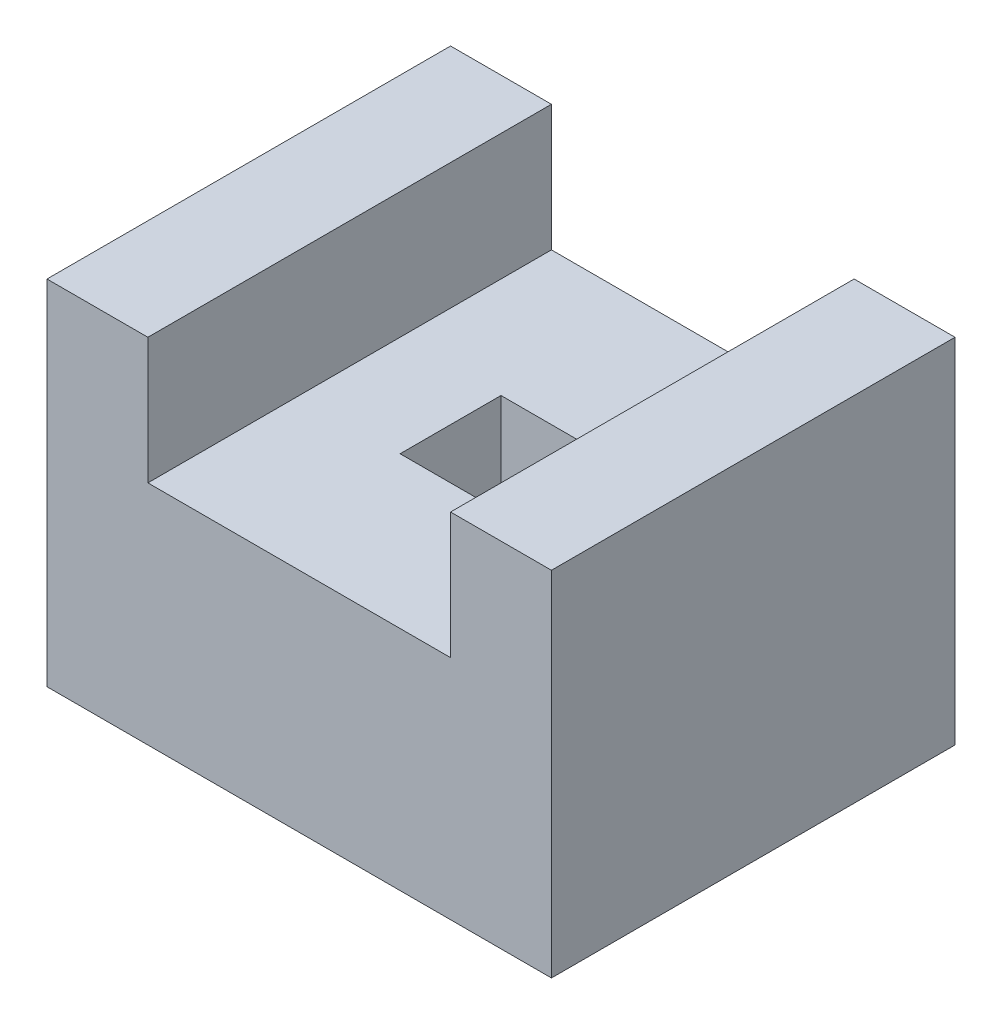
ISO-10303-21;
HEADER;
FILE_DESCRIPTION(('STEP AP214'),'2;1');
FILE_NAME('part.step','',(''),(''),'','','');
FILE_SCHEMA(('AUTOMOTIVE_DESIGN { 1 0 10303 214 1 1 1 1 }'));
ENDSEC;
DATA;
#1=APPLICATION_CONTEXT('core data for automotive mechanical design processes');
#2=APPLICATION_PROTOCOL_DEFINITION('international standard','automotive_design',2000,#1);
#3=PRODUCT_CONTEXT('',#1,'mechanical');
#4=PRODUCT('Part','Part','',(#3));
#5=PRODUCT_RELATED_PRODUCT_CATEGORY('part','',(#4));
#6=PRODUCT_DEFINITION_FORMATION('','',#4);
#7=PRODUCT_DEFINITION_CONTEXT('part definition',#1,'design');
#8=PRODUCT_DEFINITION('design','',#6,#7);
#9=PRODUCT_DEFINITION_SHAPE('','',#8);
#10=(LENGTH_UNIT() NAMED_UNIT(*) SI_UNIT(.MILLI.,.METRE.));
#11=(NAMED_UNIT(*) PLANE_ANGLE_UNIT() SI_UNIT($,.RADIAN.));
#12=(NAMED_UNIT(*) SI_UNIT($,.STERADIAN.) SOLID_ANGLE_UNIT());
#13=UNCERTAINTY_MEASURE_WITH_UNIT(LENGTH_MEASURE(1.E-05),#10,'distance_accuracy_value','');
#14=(GEOMETRIC_REPRESENTATION_CONTEXT(3) GLOBAL_UNCERTAINTY_ASSIGNED_CONTEXT((#13)) GLOBAL_UNIT_ASSIGNED_CONTEXT((#10,
#11,#12)) REPRESENTATION_CONTEXT('',''));
#15=CARTESIAN_POINT('',(0.,0.,0.));
#16=DIRECTION('',(0.,0.,1.));
#17=DIRECTION('',(1.,0.,0.));
#18=AXIS2_PLACEMENT_3D('',#15,#16,#17);
#19=CARTESIAN_POINT('',(-50.,35.,-80.));
#20=DIRECTION('',(-1.,0.,0.));
#21=DIRECTION('',(0.,0.,1.));
#22=AXIS2_PLACEMENT_3D('',#19,#20,#21);
#23=PLANE('',#22);
#24=DIRECTION('',(0.,-1.,0.));
#25=VECTOR('',#24,1.);
#26=CARTESIAN_POINT('',(-50.,35.,0.));
#27=LINE('',#26,#25);
#28=CARTESIAN_POINT('',(-50.,35.,0.));
#29=VERTEX_POINT('',#28);
#30=CARTESIAN_POINT('',(-50.,-35.,0.));
#31=VERTEX_POINT('',#30);
#32=EDGE_CURVE('E153',#29,#31,#27,.T.);
#33=ORIENTED_EDGE('',*,*,#32,.F.);
#34=DIRECTION('',(0.,0.,1.));
#35=VECTOR('',#34,1.);
#36=CARTESIAN_POINT('',(-50.,35.,-80.));
#37=LINE('',#36,#35);
#38=CARTESIAN_POINT('',(-50.,35.,-80.));
#39=VERTEX_POINT('',#38);
#40=EDGE_CURVE('E11',#39,#29,#37,.T.);
#41=ORIENTED_EDGE('',*,*,#40,.F.);
#42=DIRECTION('',(0.,-1.,0.));
#43=VECTOR('',#42,1.);
#44=CARTESIAN_POINT('',(-50.,35.,-80.));
#45=LINE('',#44,#43);
#46=CARTESIAN_POINT('',(-50.,-35.,-80.));
#47=VERTEX_POINT('',#46);
#48=EDGE_CURVE('E157',#39,#47,#45,.T.);
#49=ORIENTED_EDGE('',*,*,#48,.T.);
#50=DIRECTION('',(0.,0.,1.));
#51=VECTOR('',#50,1.);
#52=CARTESIAN_POINT('',(-50.,-35.,-80.));
#53=LINE('',#52,#51);
#54=EDGE_CURVE('E34',#47,#31,#53,.T.);
#55=ORIENTED_EDGE('',*,*,#54,.T.);
#56=EDGE_LOOP('',(#33,#41,#49,#55));
#57=FACE_BOUND('',#56,.T.);
#58=ADVANCED_FACE('F31',(#57),#23,.T.);
#59=CARTESIAN_POINT('',(-50.,35.,-80.));
#60=DIRECTION('',(0.,1.,0.));
#61=DIRECTION('',(0.,0.,1.));
#62=AXIS2_PLACEMENT_3D('',#59,#60,#61);
#63=PLANE('',#62);
#64=DIRECTION('',(-1.,0.,0.));
#65=VECTOR('',#64,1.);
#66=CARTESIAN_POINT('',(-50.,35.,0.));
#67=LINE('',#66,#65);
#68=CARTESIAN_POINT('',(-30.,35.,0.));
#69=VERTEX_POINT('',#68);
#70=EDGE_CURVE('E161',#69,#29,#67,.T.);
#71=ORIENTED_EDGE('',*,*,#70,.F.);
#72=DIRECTION('',(0.,0.,1.));
#73=VECTOR('',#72,1.);
#74=CARTESIAN_POINT('',(-30.,35.,-80.));
#75=LINE('',#74,#73);
#76=CARTESIAN_POINT('',(-30.,35.,-80.));
#77=VERTEX_POINT('',#76);
#78=EDGE_CURVE('E39',#77,#69,#75,.T.);
#79=ORIENTED_EDGE('',*,*,#78,.F.);
#80=DIRECTION('',(-1.,0.,0.));
#81=VECTOR('',#80,1.);
#82=CARTESIAN_POINT('',(-50.,35.,-80.));
#83=LINE('',#82,#81);
#84=EDGE_CURVE('E179',#77,#39,#83,.T.);
#85=ORIENTED_EDGE('',*,*,#84,.T.);
#86=ORIENTED_EDGE('',*,*,#40,.T.);
#87=EDGE_LOOP('',(#71,#79,#85,#86));
#88=FACE_BOUND('',#87,.T.);
#89=ADVANCED_FACE('F224',(#88),#63,.T.);
#90=CARTESIAN_POINT('',(-30.,10.,-80.));
#91=DIRECTION('',(1.,0.,0.));
#92=DIRECTION('',(0.,1.,0.));
#93=AXIS2_PLACEMENT_3D('',#90,#91,#92);
#94=PLANE('',#93);
#95=DIRECTION('',(0.,1.,0.));
#96=VECTOR('',#95,1.);
#97=CARTESIAN_POINT('',(-30.,10.,0.));
#98=LINE('',#97,#96);
#99=CARTESIAN_POINT('',(-30.,10.,0.));
#100=VERTEX_POINT('',#99);
#101=EDGE_CURVE('E199',#100,#69,#98,.T.);
#102=ORIENTED_EDGE('',*,*,#101,.F.);
#103=DIRECTION('',(0.,0.,1.));
#104=VECTOR('',#103,1.);
#105=CARTESIAN_POINT('',(-30.,10.,-80.));
#106=LINE('',#105,#104);
#107=CARTESIAN_POINT('',(-30.,10.,-80.));
#108=VERTEX_POINT('',#107);
#109=EDGE_CURVE('E205',#108,#100,#106,.T.);
#110=ORIENTED_EDGE('',*,*,#109,.F.);
#111=DIRECTION('',(0.,1.,0.));
#112=VECTOR('',#111,1.);
#113=CARTESIAN_POINT('',(-30.,10.,-80.));
#114=LINE('',#113,#112);
#115=EDGE_CURVE('E176',#108,#77,#114,.T.);
#116=ORIENTED_EDGE('',*,*,#115,.T.);
#117=ORIENTED_EDGE('',*,*,#78,.T.);
#118=EDGE_LOOP('',(#102,#110,#116,#117));
#119=FACE_BOUND('',#118,.T.);
#120=ADVANCED_FACE('F245',(#119),#94,.T.);
#121=CARTESIAN_POINT('',(30.,10.,-80.));
#122=DIRECTION('',(0.,1.,0.));
#123=DIRECTION('',(0.,0.,1.));
#124=AXIS2_PLACEMENT_3D('',#121,#122,#123);
#125=PLANE('',#124);
#126=DIRECTION('',(0.,0.,1.));
#127=VECTOR('',#126,1.);
#128=CARTESIAN_POINT('',(-10.,10.,-50.));
#129=LINE('',#128,#127);
#130=CARTESIAN_POINT('',(-10.,10.,-50.));
#131=VERTEX_POINT('',#130);
#132=CARTESIAN_POINT('',(-10.,10.,-30.));
#133=VERTEX_POINT('',#132);
#134=EDGE_CURVE('E47',#131,#133,#129,.T.);
#135=ORIENTED_EDGE('',*,*,#134,.F.);
#136=DIRECTION('',(-1.,0.,0.));
#137=VECTOR('',#136,1.);
#138=CARTESIAN_POINT('',(-10.,10.,-50.));
#139=LINE('',#138,#137);
#140=CARTESIAN_POINT('',(10.,10.,-50.));
#141=VERTEX_POINT('',#140);
#142=EDGE_CURVE('E138',#141,#131,#139,.T.);
#143=ORIENTED_EDGE('',*,*,#142,.F.);
#144=DIRECTION('',(0.,0.,-1.));
#145=VECTOR('',#144,1.);
#146=CARTESIAN_POINT('',(10.,10.,-50.));
#147=LINE('',#146,#145);
#148=CARTESIAN_POINT('',(10.,10.,-30.));
#149=VERTEX_POINT('',#148);
#150=EDGE_CURVE('E141',#149,#141,#147,.T.);
#151=ORIENTED_EDGE('',*,*,#150,.F.);
#152=DIRECTION('',(1.,0.,0.));
#153=VECTOR('',#152,1.);
#154=CARTESIAN_POINT('',(-10.,10.,-30.));
#155=LINE('',#154,#153);
#156=EDGE_CURVE('E147',#133,#149,#155,.T.);
#157=ORIENTED_EDGE('',*,*,#156,.F.);
#158=EDGE_LOOP('',(#135,#143,#151,#157));
#159=FACE_BOUND('',#158,.T.);
#160=DIRECTION('',(-1.,0.,0.));
#161=VECTOR('',#160,1.);
#162=CARTESIAN_POINT('',(30.,10.,0.));
#163=LINE('',#162,#161);
#164=CARTESIAN_POINT('',(30.,10.,0.));
#165=VERTEX_POINT('',#164);
#166=EDGE_CURVE('E196',#165,#100,#163,.T.);
#167=ORIENTED_EDGE('',*,*,#166,.F.);
#168=DIRECTION('',(0.,0.,1.));
#169=VECTOR('',#168,1.);
#170=CARTESIAN_POINT('',(30.,10.,-80.));
#171=LINE('',#170,#169);
#172=CARTESIAN_POINT('',(30.,10.,-80.));
#173=VERTEX_POINT('',#172);
#174=EDGE_CURVE('E207',#173,#165,#171,.T.);
#175=ORIENTED_EDGE('',*,*,#174,.F.);
#176=DIRECTION('',(-1.,0.,0.));
#177=VECTOR('',#176,1.);
#178=CARTESIAN_POINT('',(30.,10.,-80.));
#179=LINE('',#178,#177);
#180=EDGE_CURVE('E173',#173,#108,#179,.T.);
#181=ORIENTED_EDGE('',*,*,#180,.T.);
#182=ORIENTED_EDGE('',*,*,#109,.T.);
#183=EDGE_LOOP('',(#167,#175,#181,#182));
#184=FACE_BOUND('',#183,.T.);
#185=ADVANCED_FACE('F243',(#159,#184),#125,.T.);
#186=CARTESIAN_POINT('',(30.,35.,-80.));
#187=DIRECTION('',(-1.,0.,0.));
#188=DIRECTION('',(0.,-1.,0.));
#189=AXIS2_PLACEMENT_3D('',#186,#187,#188);
#190=PLANE('',#189);
#191=DIRECTION('',(0.,-1.,0.));
#192=VECTOR('',#191,1.);
#193=CARTESIAN_POINT('',(30.,35.,0.));
#194=LINE('',#193,#192);
#195=CARTESIAN_POINT('',(30.,35.,0.));
#196=VERTEX_POINT('',#195);
#197=EDGE_CURVE('E193',#196,#165,#194,.T.);
#198=ORIENTED_EDGE('',*,*,#197,.F.);
#199=DIRECTION('',(0.,0.,1.));
#200=VECTOR('',#199,1.);
#201=CARTESIAN_POINT('',(30.,35.,-80.));
#202=LINE('',#201,#200);
#203=CARTESIAN_POINT('',(30.,35.,-80.));
#204=VERTEX_POINT('',#203);
#205=EDGE_CURVE('E209',#204,#196,#202,.T.);
#206=ORIENTED_EDGE('',*,*,#205,.F.);
#207=DIRECTION('',(0.,-1.,0.));
#208=VECTOR('',#207,1.);
#209=CARTESIAN_POINT('',(30.,35.,-80.));
#210=LINE('',#209,#208);
#211=EDGE_CURVE('E170',#204,#173,#210,.T.);
#212=ORIENTED_EDGE('',*,*,#211,.T.);
#213=ORIENTED_EDGE('',*,*,#174,.T.);
#214=EDGE_LOOP('',(#198,#206,#212,#213));
#215=FACE_BOUND('',#214,.T.);
#216=ADVANCED_FACE('F239',(#215),#190,.T.);
#217=CARTESIAN_POINT('',(30.,35.,-80.));
#218=DIRECTION('',(0.,1.,0.));
#219=DIRECTION('',(0.,0.,1.));
#220=AXIS2_PLACEMENT_3D('',#217,#218,#219);
#221=PLANE('',#220);
#222=DIRECTION('',(-1.,0.,0.));
#223=VECTOR('',#222,1.);
#224=CARTESIAN_POINT('',(30.,35.,0.));
#225=LINE('',#224,#223);
#226=CARTESIAN_POINT('',(50.,35.,0.));
#227=VERTEX_POINT('',#226);
#228=EDGE_CURVE('E190',#227,#196,#225,.T.);
#229=ORIENTED_EDGE('',*,*,#228,.F.);
#230=DIRECTION('',(0.,0.,1.));
#231=VECTOR('',#230,1.);
#232=CARTESIAN_POINT('',(50.,35.,-80.));
#233=LINE('',#232,#231);
#234=CARTESIAN_POINT('',(50.,35.,-80.));
#235=VERTEX_POINT('',#234);
#236=EDGE_CURVE('E211',#235,#227,#233,.T.);
#237=ORIENTED_EDGE('',*,*,#236,.F.);
#238=DIRECTION('',(-1.,0.,0.));
#239=VECTOR('',#238,1.);
#240=CARTESIAN_POINT('',(30.,35.,-80.));
#241=LINE('',#240,#239);
#242=EDGE_CURVE('E167',#235,#204,#241,.T.);
#243=ORIENTED_EDGE('',*,*,#242,.T.);
#244=ORIENTED_EDGE('',*,*,#205,.T.);
#245=EDGE_LOOP('',(#229,#237,#243,#244));
#246=FACE_BOUND('',#245,.T.);
#247=ADVANCED_FACE('F237',(#246),#221,.T.);
#248=CARTESIAN_POINT('',(50.,35.,-80.));
#249=DIRECTION('',(1.,0.,0.));
#250=DIRECTION('',(0.,0.,-1.));
#251=AXIS2_PLACEMENT_3D('',#248,#249,#250);
#252=PLANE('',#251);
#253=DIRECTION('',(0.,1.,0.));
#254=VECTOR('',#253,1.);
#255=CARTESIAN_POINT('',(50.,35.,0.));
#256=LINE('',#255,#254);
#257=CARTESIAN_POINT('',(50.,-35.,0.));
#258=VERTEX_POINT('',#257);
#259=EDGE_CURVE('E187',#258,#227,#256,.T.);
#260=ORIENTED_EDGE('',*,*,#259,.F.);
#261=DIRECTION('',(0.,0.,1.));
#262=VECTOR('',#261,1.);
#263=CARTESIAN_POINT('',(50.,-35.,-80.));
#264=LINE('',#263,#262);
#265=CARTESIAN_POINT('',(50.,-35.,-80.));
#266=VERTEX_POINT('',#265);
#267=EDGE_CURVE('E212',#266,#258,#264,.T.);
#268=ORIENTED_EDGE('',*,*,#267,.F.);
#269=DIRECTION('',(0.,1.,0.));
#270=VECTOR('',#269,1.);
#271=CARTESIAN_POINT('',(50.,35.,-80.));
#272=LINE('',#271,#270);
#273=EDGE_CURVE('E164',#266,#235,#272,.T.);
#274=ORIENTED_EDGE('',*,*,#273,.T.);
#275=ORIENTED_EDGE('',*,*,#236,.T.);
#276=EDGE_LOOP('',(#260,#268,#274,#275));
#277=FACE_BOUND('',#276,.T.);
#278=ADVANCED_FACE('F233',(#277),#252,.T.);
#279=CARTESIAN_POINT('',(-50.,-35.,-80.));
#280=DIRECTION('',(0.,-1.,0.));
#281=DIRECTION('',(0.,0.,-1.));
#282=AXIS2_PLACEMENT_3D('',#279,#280,#281);
#283=PLANE('',#282);
#284=DIRECTION('',(0.,0.,1.));
#285=VECTOR('',#284,1.);
#286=CARTESIAN_POINT('',(-10.,-35.,-50.));
#287=LINE('',#286,#285);
#288=CARTESIAN_POINT('',(-10.,-35.,-50.));
#289=VERTEX_POINT('',#288);
#290=CARTESIAN_POINT('',(-10.,-35.,-30.));
#291=VERTEX_POINT('',#290);
#292=EDGE_CURVE('E122',#289,#291,#287,.T.);
#293=ORIENTED_EDGE('',*,*,#292,.T.);
#294=DIRECTION('',(1.,0.,0.));
#295=VECTOR('',#294,1.);
#296=CARTESIAN_POINT('',(-10.,-35.,-30.));
#297=LINE('',#296,#295);
#298=CARTESIAN_POINT('',(9.99999999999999,-35.,-30.));
#299=VERTEX_POINT('',#298);
#300=EDGE_CURVE('E131',#291,#299,#297,.T.);
#301=ORIENTED_EDGE('',*,*,#300,.T.);
#302=DIRECTION('',(0.,0.,-1.));
#303=VECTOR('',#302,1.);
#304=CARTESIAN_POINT('',(10.,-35.,-50.));
#305=LINE('',#304,#303);
#306=CARTESIAN_POINT('',(10.,-35.,-50.));
#307=VERTEX_POINT('',#306);
#308=EDGE_CURVE('E55',#299,#307,#305,.T.);
#309=ORIENTED_EDGE('',*,*,#308,.T.);
#310=DIRECTION('',(-1.,0.,0.));
#311=VECTOR('',#310,1.);
#312=CARTESIAN_POINT('',(-10.,-35.,-50.));
#313=LINE('',#312,#311);
#314=EDGE_CURVE('E128',#307,#289,#313,.T.);
#315=ORIENTED_EDGE('',*,*,#314,.T.);
#316=EDGE_LOOP('',(#293,#301,#309,#315));
#317=FACE_BOUND('',#316,.T.);
#318=DIRECTION('',(1.,0.,0.));
#319=VECTOR('',#318,1.);
#320=CARTESIAN_POINT('',(-50.,-35.,0.));
#321=LINE('',#320,#319);
#322=EDGE_CURVE('E184',#31,#258,#321,.T.);
#323=ORIENTED_EDGE('',*,*,#322,.F.);
#324=ORIENTED_EDGE('',*,*,#54,.F.);
#325=DIRECTION('',(1.,0.,0.));
#326=VECTOR('',#325,1.);
#327=CARTESIAN_POINT('',(-50.,-35.,-80.));
#328=LINE('',#327,#326);
#329=EDGE_CURVE('E160',#47,#266,#328,.T.);
#330=ORIENTED_EDGE('',*,*,#329,.T.);
#331=ORIENTED_EDGE('',*,*,#267,.T.);
#332=EDGE_LOOP('',(#323,#324,#330,#331));
#333=FACE_BOUND('',#332,.T.);
#334=ADVANCED_FACE('F135',(#317,#333),#283,.T.);
#335=CARTESIAN_POINT('',(-50.,-35.,-80.));
#336=DIRECTION('',(0.,0.,1.));
#337=DIRECTION('',(1.,0.,0.));
#338=AXIS2_PLACEMENT_3D('',#335,#336,#337);
#339=PLANE('',#338);
#340=ORIENTED_EDGE('',*,*,#48,.F.);
#341=ORIENTED_EDGE('',*,*,#84,.F.);
#342=ORIENTED_EDGE('',*,*,#115,.F.);
#343=ORIENTED_EDGE('',*,*,#180,.F.);
#344=ORIENTED_EDGE('',*,*,#211,.F.);
#345=ORIENTED_EDGE('',*,*,#242,.F.);
#346=ORIENTED_EDGE('',*,*,#273,.F.);
#347=ORIENTED_EDGE('',*,*,#329,.F.);
#348=EDGE_LOOP('',(#340,#341,#342,#343,#344,#345,#346,#347));
#349=FACE_BOUND('',#348,.T.);
#350=ADVANCED_FACE('F227',(#349),#339,.F.);
#351=CARTESIAN_POINT('',(-50.,-35.,0.));
#352=DIRECTION('',(0.,0.,1.));
#353=DIRECTION('',(1.,0.,0.));
#354=AXIS2_PLACEMENT_3D('',#351,#352,#353);
#355=PLANE('',#354);
#356=ORIENTED_EDGE('',*,*,#32,.T.);
#357=ORIENTED_EDGE('',*,*,#322,.T.);
#358=ORIENTED_EDGE('',*,*,#259,.T.);
#359=ORIENTED_EDGE('',*,*,#228,.T.);
#360=ORIENTED_EDGE('',*,*,#197,.T.);
#361=ORIENTED_EDGE('',*,*,#166,.T.);
#362=ORIENTED_EDGE('',*,*,#101,.T.);
#363=ORIENTED_EDGE('',*,*,#70,.T.);
#364=EDGE_LOOP('',(#356,#357,#358,#359,#360,#361,#362,#363));
#365=FACE_BOUND('',#364,.T.);
#366=ADVANCED_FACE('F220',(#365),#355,.T.);
#367=CARTESIAN_POINT('',(-10.,-35.,-50.));
#368=DIRECTION('',(-1.,0.,0.));
#369=DIRECTION('',(0.,0.,1.));
#370=AXIS2_PLACEMENT_3D('',#367,#368,#369);
#371=PLANE('',#370);
#372=ORIENTED_EDGE('',*,*,#134,.T.);
#373=DIRECTION('',(0.,1.,0.));
#374=VECTOR('',#373,1.);
#375=CARTESIAN_POINT('',(-10.,-35.,-30.));
#376=LINE('',#375,#374);
#377=EDGE_CURVE('E118',#291,#133,#376,.T.);
#378=ORIENTED_EDGE('',*,*,#377,.F.);
#379=ORIENTED_EDGE('',*,*,#292,.F.);
#380=DIRECTION('',(0.,1.,0.));
#381=VECTOR('',#380,1.);
#382=CARTESIAN_POINT('',(-10.,-35.,-50.));
#383=LINE('',#382,#381);
#384=EDGE_CURVE('E151',#289,#131,#383,.T.);
#385=ORIENTED_EDGE('',*,*,#384,.T.);
#386=EDGE_LOOP('',(#372,#378,#379,#385));
#387=FACE_BOUND('',#386,.T.);
#388=ADVANCED_FACE('F120',(#387),#371,.F.);
#389=CARTESIAN_POINT('',(-10.,-35.,-50.));
#390=DIRECTION('',(0.,0.,-1.));
#391=DIRECTION('',(-1.,0.,0.));
#392=AXIS2_PLACEMENT_3D('',#389,#390,#391);
#393=PLANE('',#392);
#394=ORIENTED_EDGE('',*,*,#142,.T.);
#395=ORIENTED_EDGE('',*,*,#384,.F.);
#396=ORIENTED_EDGE('',*,*,#314,.F.);
#397=DIRECTION('',(0.,1.,0.));
#398=VECTOR('',#397,1.);
#399=CARTESIAN_POINT('',(10.,-35.,-50.));
#400=LINE('',#399,#398);
#401=EDGE_CURVE('E154',#307,#141,#400,.T.);
#402=ORIENTED_EDGE('',*,*,#401,.T.);
#403=EDGE_LOOP('',(#394,#395,#396,#402));
#404=FACE_BOUND('',#403,.T.);
#405=ADVANCED_FACE('F328',(#404),#393,.F.);
#406=CARTESIAN_POINT('',(10.,-35.,-50.));
#407=DIRECTION('',(1.,0.,0.));
#408=DIRECTION('',(0.,0.,-1.));
#409=AXIS2_PLACEMENT_3D('',#406,#407,#408);
#410=PLANE('',#409);
#411=ORIENTED_EDGE('',*,*,#150,.T.);
#412=ORIENTED_EDGE('',*,*,#401,.F.);
#413=ORIENTED_EDGE('',*,*,#308,.F.);
#414=DIRECTION('',(0.,1.,0.));
#415=VECTOR('',#414,1.);
#416=CARTESIAN_POINT('',(10.,-35.,-30.));
#417=LINE('',#416,#415);
#418=EDGE_CURVE('E127',#299,#149,#417,.T.);
#419=ORIENTED_EDGE('',*,*,#418,.T.);
#420=EDGE_LOOP('',(#411,#412,#413,#419));
#421=FACE_BOUND('',#420,.T.);
#422=ADVANCED_FACE('F337',(#421),#410,.F.);
#423=CARTESIAN_POINT('',(-10.,-35.,-30.));
#424=DIRECTION('',(0.,0.,1.));
#425=DIRECTION('',(1.,0.,0.));
#426=AXIS2_PLACEMENT_3D('',#423,#424,#425);
#427=PLANE('',#426);
#428=ORIENTED_EDGE('',*,*,#156,.T.);
#429=ORIENTED_EDGE('',*,*,#418,.F.);
#430=ORIENTED_EDGE('',*,*,#300,.F.);
#431=ORIENTED_EDGE('',*,*,#377,.T.);
#432=EDGE_LOOP('',(#428,#429,#430,#431));
#433=FACE_BOUND('',#432,.T.);
#434=ADVANCED_FACE('F132',(#433),#427,.F.);
#435=CLOSED_SHELL('',(#58,#89,#120,#185,#216,#247,#278,#334,#350,#366,#388,#405,#422,#434));
#436=MANIFOLD_SOLID_BREP('B2',#435);
#437=ADVANCED_BREP_SHAPE_REPRESENTATION('',(#18,#436),#14);
#438=SHAPE_DEFINITION_REPRESENTATION(#9,#437);
ENDSEC;
END-ISO-10303-21;
